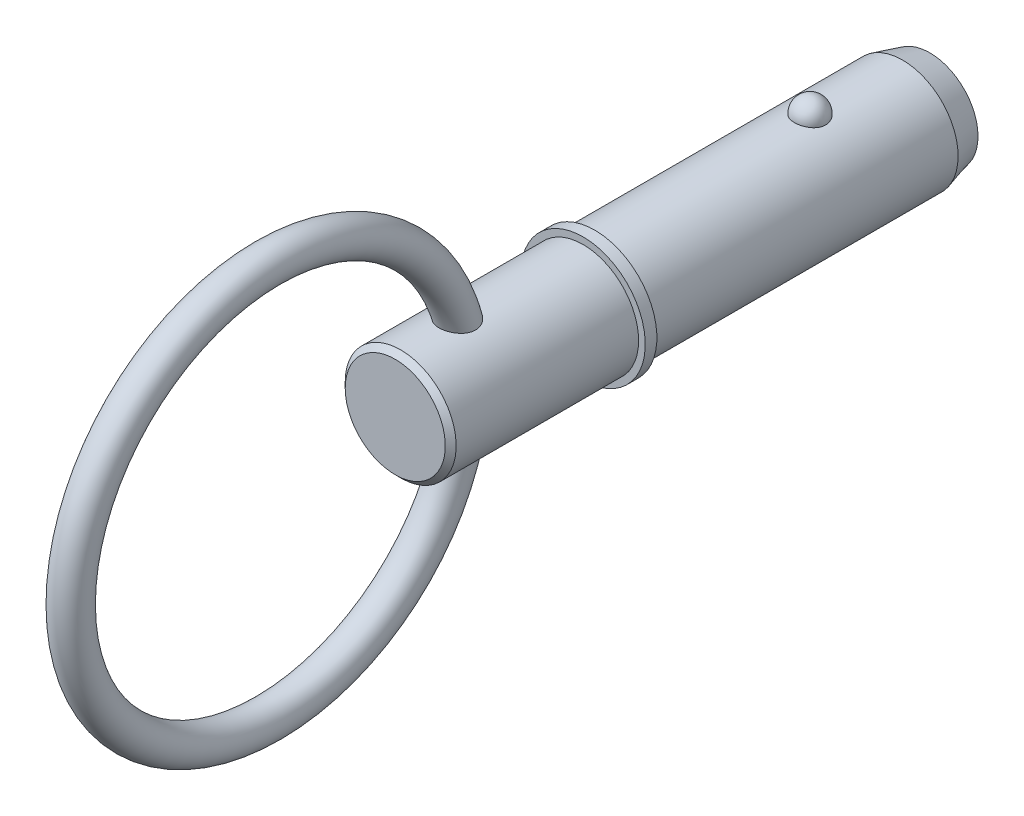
ISO-10303-21;
HEADER;
FILE_DESCRIPTION(('STEP AP214'),'2;1');
FILE_NAME('part.step','',(''),(''),'','','');
FILE_SCHEMA(('AUTOMOTIVE_DESIGN { 1 0 10303 214 1 1 1 1 }'));
ENDSEC;
DATA;
#1=APPLICATION_CONTEXT('core data for automotive mechanical design processes');
#2=APPLICATION_PROTOCOL_DEFINITION('international standard','automotive_design',2000,#1);
#3=PRODUCT_CONTEXT('',#1,'mechanical');
#4=PRODUCT('Part','Part','',(#3));
#5=PRODUCT_RELATED_PRODUCT_CATEGORY('part','',(#4));
#6=PRODUCT_DEFINITION_FORMATION('','',#4);
#7=PRODUCT_DEFINITION_CONTEXT('part definition',#1,'design');
#8=PRODUCT_DEFINITION('design','',#6,#7);
#9=PRODUCT_DEFINITION_SHAPE('','',#8);
#10=(LENGTH_UNIT() NAMED_UNIT(*) SI_UNIT(.MILLI.,.METRE.));
#11=(NAMED_UNIT(*) PLANE_ANGLE_UNIT() SI_UNIT($,.RADIAN.));
#12=(NAMED_UNIT(*) SI_UNIT($,.STERADIAN.) SOLID_ANGLE_UNIT());
#13=UNCERTAINTY_MEASURE_WITH_UNIT(LENGTH_MEASURE(1.E-05),#10,'distance_accuracy_value','');
#14=(GEOMETRIC_REPRESENTATION_CONTEXT(3) GLOBAL_UNCERTAINTY_ASSIGNED_CONTEXT((#13)) GLOBAL_UNIT_ASSIGNED_CONTEXT((#10,
#11,#12)) REPRESENTATION_CONTEXT('',''));
#15=CARTESIAN_POINT('',(0.,0.,0.));
#16=DIRECTION('',(0.,0.,1.));
#17=DIRECTION('',(1.,0.,0.));
#18=AXIS2_PLACEMENT_3D('',#15,#16,#17);
#19=CARTESIAN_POINT('',(0.,0.,25.7));
#20=DIRECTION('',(0.,0.,-1.));
#21=DIRECTION('',(-1.,0.,0.));
#22=AXIS2_PLACEMENT_3D('',#19,#20,#21);
#23=CYLINDRICAL_SURFACE('',#22,7.145);
#24=CARTESIAN_POINT('',(1.99971637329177,6.85945766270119,-2.01999999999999));
#25=CARTESIAN_POINT('',(1.9997145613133,6.85945924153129,-1.90709736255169));
#26=CARTESIAN_POINT('',(1.99051486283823,6.86216053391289,-1.79417185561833));
#27=CARTESIAN_POINT('',(1.95393597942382,6.87266409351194,-1.57152267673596));
#28=CARTESIAN_POINT('',(1.92655029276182,6.88046818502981,-1.46180016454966));
#29=CARTESIAN_POINT('',(1.85429435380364,6.90029063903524,-1.24873107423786));
#30=CARTESIAN_POINT('',(1.80943177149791,6.91230715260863,-1.14538172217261));
#31=CARTESIAN_POINT('',(1.70333474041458,6.93921158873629,-0.947875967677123));
#32=CARTESIAN_POINT('',(1.64210059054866,6.95409945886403,-0.853719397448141));
#33=CARTESIAN_POINT('',(1.5044381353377,6.98517577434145,-0.676721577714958));
#34=CARTESIAN_POINT('',(1.42793505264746,7.00137037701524,-0.593939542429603));
#35=CARTESIAN_POINT('',(1.26189697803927,7.03319066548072,-0.442536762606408));
#36=CARTESIAN_POINT('',(1.17236198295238,7.04881635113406,-0.373916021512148));
#37=CARTESIAN_POINT('',(0.982932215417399,7.0777121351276,-0.252935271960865));
#38=CARTESIAN_POINT('',(0.883068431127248,7.09098897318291,-0.200528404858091));
#39=CARTESIAN_POINT('',(0.675560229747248,7.11375589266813,-0.113212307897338));
#40=CARTESIAN_POINT('',(0.567916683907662,7.12324639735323,-0.0783011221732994));
#41=CARTESIAN_POINT('',(0.350006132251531,7.13724173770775,-0.0274707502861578));
#42=CARTESIAN_POINT('',(0.239822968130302,7.14183447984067,-0.0112162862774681));
#43=CARTESIAN_POINT('',(0.018194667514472,7.14583597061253,0.00296794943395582));
#44=CARTESIAN_POINT('',(-0.093250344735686,7.14524522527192,0.000899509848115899));
#45=CARTESIAN_POINT('',(-0.312527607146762,7.13899247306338,-0.0213331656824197));
#46=CARTESIAN_POINT('',(-0.420388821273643,7.13340426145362,-0.041234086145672));
#47=CARTESIAN_POINT('',(-0.631141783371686,7.11785474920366,-0.0982040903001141));
#48=CARTESIAN_POINT('',(-0.734033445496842,7.10789337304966,-0.135273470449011));
#49=CARTESIAN_POINT('',(-0.932634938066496,7.08458058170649,-0.225826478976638));
#50=CARTESIAN_POINT('',(-1.02829911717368,7.07120963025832,-0.279405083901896));
#51=CARTESIAN_POINT('',(-1.20927180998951,7.04252043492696,-0.401457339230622));
#52=CARTESIAN_POINT('',(-1.29457925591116,7.02720199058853,-0.469932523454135));
#53=CARTESIAN_POINT('',(-1.45423311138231,6.995926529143,-0.6214381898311));
#54=CARTESIAN_POINT('',(-1.5283348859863,6.97996288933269,-0.704725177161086));
#55=CARTESIAN_POINT('',(-1.66169281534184,6.94942414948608,-0.882667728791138));
#56=CARTESIAN_POINT('',(-1.72094789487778,6.93484915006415,-0.977324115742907));
#57=CARTESIAN_POINT('',(-1.82375276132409,6.90853186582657,-1.17661373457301));
#58=CARTESIAN_POINT('',(-1.86711024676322,6.8968248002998,-1.28135093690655));
#59=CARTESIAN_POINT('',(-1.9360425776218,6.87779420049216,-1.49689986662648));
#60=CARTESIAN_POINT('',(-1.96161794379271,6.87047053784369,-1.60771141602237));
#61=CARTESIAN_POINT('',(-1.99427437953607,6.86106309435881,-1.83176258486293));
#62=CARTESIAN_POINT('',(-2.00143373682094,6.8589571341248,-1.94498985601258));
#63=CARTESIAN_POINT('',(-1.99730449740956,6.86016064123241,-2.17107603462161));
#64=CARTESIAN_POINT('',(-1.98601641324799,6.86346995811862,-2.28393495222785));
#65=CARTESIAN_POINT('',(-1.94538181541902,6.87509649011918,-2.50548437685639));
#66=CARTESIAN_POINT('',(-1.91612773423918,6.88338806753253,-2.61419321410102));
#67=CARTESIAN_POINT('',(-1.84036449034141,6.90402888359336,-2.82501243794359));
#68=CARTESIAN_POINT('',(-1.79385462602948,6.91637828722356,-2.92712255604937));
#69=CARTESIAN_POINT('',(-1.68442067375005,6.94384180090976,-3.12247704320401));
#70=CARTESIAN_POINT('',(-1.62140729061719,6.95897081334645,-3.21566929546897));
#71=CARTESIAN_POINT('',(-1.4806650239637,6.99026742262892,-3.38999412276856));
#72=CARTESIAN_POINT('',(-1.40293556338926,7.00643506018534,-3.47112622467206));
#73=CARTESIAN_POINT('',(-1.2344320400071,7.03807960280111,-3.61938672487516));
#74=CARTESIAN_POINT('',(-1.1436092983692,7.05355363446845,-3.68646046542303));
#75=CARTESIAN_POINT('',(-0.9515914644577,7.08201263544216,-3.80431973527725));
#76=CARTESIAN_POINT('',(-0.850397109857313,7.09499778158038,-3.85510642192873));
#77=CARTESIAN_POINT('',(-0.641823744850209,7.11687679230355,-3.93839532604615));
#78=CARTESIAN_POINT('',(-0.534539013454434,7.1258202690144,-3.97112042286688));
#79=CARTESIAN_POINT('',(-0.315743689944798,7.1388605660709,-4.01830716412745));
#80=CARTESIAN_POINT('',(-0.204233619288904,7.14295798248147,-4.03277105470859));
#81=CARTESIAN_POINT('',(0.017551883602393,7.14582273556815,-4.04291389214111));
#82=CARTESIAN_POINT('',(0.127809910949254,7.14469090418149,-4.03894819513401));
#83=CARTESIAN_POINT('',(0.346044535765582,7.13745046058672,-4.01315850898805));
#84=CARTESIAN_POINT('',(0.454021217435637,7.13134203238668,-3.99133518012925));
#85=CARTESIAN_POINT('',(0.664227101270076,7.11483713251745,-3.93057164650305));
#86=CARTESIAN_POINT('',(0.766477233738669,7.10445761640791,-3.89169908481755));
#87=CARTESIAN_POINT('',(0.96292921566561,7.08050813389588,-3.79792023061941));
#88=CARTESIAN_POINT('',(1.05713054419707,7.06693796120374,-3.74301290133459));
#89=CARTESIAN_POINT('',(1.23644031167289,7.03780007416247,-3.61765173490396));
#90=CARTESIAN_POINT('',(1.32138387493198,7.0222044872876,-3.5469686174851));
#91=CARTESIAN_POINT('',(1.47830582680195,6.99085504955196,-3.39245228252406));
#92=CARTESIAN_POINT('',(1.55028198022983,6.97510117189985,-3.30861680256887));
#93=CARTESIAN_POINT('',(1.68063701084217,6.94485803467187,-3.12843058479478));
#94=CARTESIAN_POINT('',(1.73875175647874,6.93039619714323,-3.03188405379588));
#95=CARTESIAN_POINT('',(1.83823393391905,6.90467783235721,-2.83015210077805));
#96=CARTESIAN_POINT('',(1.87960712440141,6.89342020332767,-2.72496966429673));
#97=CARTESIAN_POINT('',(1.94111647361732,6.87633596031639,-2.52050234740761));
#98=CARTESIAN_POINT('',(1.96305249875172,6.87005682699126,-2.42179225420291));
#99=CARTESIAN_POINT('',(1.99235308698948,6.86161702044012,-2.22206084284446));
#100=CARTESIAN_POINT('',(1.99971799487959,6.85945624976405,-2.12103957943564));
#101=CARTESIAN_POINT('',(1.99971637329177,6.85945766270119,-2.01999999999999));
#102=B_SPLINE_CURVE_WITH_KNOTS('',3,(#24,#25,#26,#27,#28,#29,#30,#31,#32,#33,#34,#35,#36,#37,
#38,#39,#40,#41,#42,#43,#44,#45,#46,#47,#48,#49,#50,#51,#52,#53,#54,#55,#56,#57,#58,#59,#60,#61,
#62,#63,#64,#65,#66,#67,#68,#69,#70,#71,#72,#73,#74,#75,#76,#77,#78,#79,#80,#81,#82,#83,#84,#85,
#86,#87,#88,#89,#90,#91,#92,#93,#94,#95,#96,#97,#98,#99,#100,#101),.UNSPECIFIED.,.T.,.F.,(4,2,2,
2,2,2,2,2,2,2,2,2,2,2,2,2,2,2,2,2,2,2,2,2,2,2,2,2,2,2,2,2,2,2,2,2,2,2,4),(0.,0.338345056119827,
0.676811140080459,1.01512885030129,1.35344038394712,1.69345130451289,2.0334623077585,
2.37248128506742,2.71146235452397,3.04425125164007,3.37700766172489,3.70493009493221,
4.03285819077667,4.36270921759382,4.69259422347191,5.02887632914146,5.36518278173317,
5.70543263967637,6.04567253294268,6.38446363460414,6.72324532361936,7.06029846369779,
7.39736530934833,7.73629500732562,8.07523799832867,8.41547528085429,8.7556883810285,
9.09160363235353,9.42747756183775,9.75690239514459,10.0863150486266,10.4144324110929,
10.7425709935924,11.0758313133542,11.4091490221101,11.748385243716,12.0875046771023,
12.3903058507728,12.6930998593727),.UNSPECIFIED.);
#103=CARTESIAN_POINT('',(1.99971637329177,6.85945766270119,-2.01999999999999));
#104=VERTEX_POINT('',#103);
#105=EDGE_CURVE('E102',#104,#104,#102,.T.);
#106=ORIENTED_EDGE('',*,*,#105,.T.);
#107=EDGE_LOOP('',(#106));
#108=FACE_BOUND('',#107,.T.);
#109=CARTESIAN_POINT('',(0.,0.,-13.95));
#110=DIRECTION('',(0.,0.,-1.));
#111=DIRECTION('',(-1.,0.,0.));
#112=AXIS2_PLACEMENT_3D('',#109,#110,#111);
#113=CIRCLE('',#112,7.145);
#114=CARTESIAN_POINT('',(7.145,0.,-13.95));
#115=VERTEX_POINT('',#114);
#116=EDGE_CURVE('E109',#115,#115,#113,.F.);
#117=ORIENTED_EDGE('',*,*,#116,.T.);
#118=EDGE_LOOP('',(#117));
#119=FACE_BOUND('',#118,.T.);
#120=CARTESIAN_POINT('',(0.,0.,25.7));
#121=DIRECTION('',(0.,0.,1.));
#122=DIRECTION('',(1.,0.,0.));
#123=AXIS2_PLACEMENT_3D('',#120,#121,#122);
#124=CIRCLE('',#123,7.145);
#125=CARTESIAN_POINT('',(7.145,0.,25.7));
#126=VERTEX_POINT('',#125);
#127=EDGE_CURVE('E107',#126,#126,#124,.T.);
#128=ORIENTED_EDGE('',*,*,#127,.F.);
#129=EDGE_LOOP('',(#128));
#130=FACE_BOUND('',#129,.T.);
#131=ADVANCED_FACE('F39',(#108,#119,#130),#23,.T.);
#132=CARTESIAN_POINT('',(0.,0.,-17.45));
#133=DIRECTION('',(0.,0.,-1.));
#134=DIRECTION('',(-1.,0.,0.));
#135=AXIS2_PLACEMENT_3D('',#132,#133,#134);
#136=PLANE('',#135);
#137=CARTESIAN_POINT('',(0.,0.,-17.45));
#138=DIRECTION('',(0.,0.,-1.));
#139=DIRECTION('',(-1.,0.,0.));
#140=AXIS2_PLACEMENT_3D('',#137,#138,#139);
#141=CIRCLE('',#140,6.20717782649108);
#142=CARTESIAN_POINT('',(6.20717782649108,0.,-17.45));
#143=VERTEX_POINT('',#142);
#144=EDGE_CURVE('E141',#143,#143,#141,.T.);
#145=ORIENTED_EDGE('',*,*,#144,.T.);
#146=EDGE_LOOP('',(#145));
#147=FACE_BOUND('',#146,.T.);
#148=ADVANCED_FACE('F88',(#147),#136,.T.);
#149=CARTESIAN_POINT('',(0.,0.,-17.45));
#150=DIRECTION('',(0.,0.,1.));
#151=DIRECTION('',(1.,0.,0.));
#152=AXIS2_PLACEMENT_3D('',#149,#150,#151);
#153=CONICAL_SURFACE('',#152,6.20717782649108,0.261799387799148);
#154=CARTESIAN_POINT('',(7.145,0.,-13.95));
#155=CARTESIAN_POINT('',(7.13523101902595,0.,-13.9864583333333));
#156=CARTESIAN_POINT('',(7.1254620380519,0.,-14.0229166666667));
#157=CARTESIAN_POINT('',(7.1059240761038,0.,-14.0958333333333));
#158=CARTESIAN_POINT('',(7.09615509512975,0.,-14.1322916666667));
#159=CARTESIAN_POINT('',(7.07661713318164,0.,-14.2052083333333));
#160=CARTESIAN_POINT('',(7.06684815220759,0.,-14.2416666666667));
#161=CARTESIAN_POINT('',(7.04731019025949,0.,-14.3145833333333));
#162=CARTESIAN_POINT('',(7.03754120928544,0.,-14.3510416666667));
#163=CARTESIAN_POINT('',(7.01800324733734,0.,-14.4239583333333));
#164=CARTESIAN_POINT('',(7.00823426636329,0.,-14.4604166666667));
#165=CARTESIAN_POINT('',(6.98869630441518,0.,-14.5333333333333));
#166=CARTESIAN_POINT('',(6.97892732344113,0.,-14.5697916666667));
#167=CARTESIAN_POINT('',(6.95938936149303,0.,-14.6427083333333));
#168=CARTESIAN_POINT('',(6.94962038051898,0.,-14.6791666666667));
#169=CARTESIAN_POINT('',(6.93008241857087,0.,-14.7520833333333));
#170=CARTESIAN_POINT('',(6.92031343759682,0.,-14.7885416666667));
#171=CARTESIAN_POINT('',(6.90077547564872,0.,-14.8614583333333));
#172=CARTESIAN_POINT('',(6.89100649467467,0.,-14.8979166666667));
#173=CARTESIAN_POINT('',(6.87146853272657,0.,-14.9708333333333));
#174=CARTESIAN_POINT('',(6.86169955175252,0.,-15.0072916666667));
#175=CARTESIAN_POINT('',(6.84216158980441,0.,-15.0802083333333));
#176=CARTESIAN_POINT('',(6.83239260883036,0.,-15.1166666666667));
#177=CARTESIAN_POINT('',(6.81285464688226,0.,-15.1895833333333));
#178=CARTESIAN_POINT('',(6.80308566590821,0.,-15.2260416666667));
#179=CARTESIAN_POINT('',(6.78354770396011,0.,-15.2989583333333));
#180=CARTESIAN_POINT('',(6.77377872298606,0.,-15.3354166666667));
#181=CARTESIAN_POINT('',(6.75424076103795,0.,-15.4083333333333));
#182=CARTESIAN_POINT('',(6.7444717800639,0.,-15.4447916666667));
#183=CARTESIAN_POINT('',(6.7249338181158,0.,-15.5177083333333));
#184=CARTESIAN_POINT('',(6.71516483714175,0.,-15.5541666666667));
#185=CARTESIAN_POINT('',(6.69562687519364,0.,-15.6270833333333));
#186=CARTESIAN_POINT('',(6.68585789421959,0.,-15.6635416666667));
#187=CARTESIAN_POINT('',(6.66631993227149,0.,-15.7364583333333));
#188=CARTESIAN_POINT('',(6.65655095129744,0.,-15.7729166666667));
#189=CARTESIAN_POINT('',(6.63701298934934,0.,-15.8458333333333));
#190=CARTESIAN_POINT('',(6.62724400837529,0.,-15.8822916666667));
#191=CARTESIAN_POINT('',(6.60770604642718,0.,-15.9552083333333));
#192=CARTESIAN_POINT('',(6.59793706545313,0.,-15.9916666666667));
#193=CARTESIAN_POINT('',(6.57839910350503,0.,-16.0645833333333));
#194=CARTESIAN_POINT('',(6.56863012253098,0.,-16.1010416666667));
#195=CARTESIAN_POINT('',(6.54909216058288,0.,-16.1739583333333));
#196=CARTESIAN_POINT('',(6.53932317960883,0.,-16.2104166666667));
#197=CARTESIAN_POINT('',(6.51978521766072,0.,-16.2833333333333));
#198=CARTESIAN_POINT('',(6.51001623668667,0.,-16.3197916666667));
#199=CARTESIAN_POINT('',(6.49047827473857,0.,-16.3927083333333));
#200=CARTESIAN_POINT('',(6.48070929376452,0.,-16.4291666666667));
#201=CARTESIAN_POINT('',(6.46117133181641,0.,-16.5020833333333));
#202=CARTESIAN_POINT('',(6.45140235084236,0.,-16.5385416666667));
#203=CARTESIAN_POINT('',(6.43186438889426,0.,-16.6114583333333));
#204=CARTESIAN_POINT('',(6.42209540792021,0.,-16.6479166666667));
#205=CARTESIAN_POINT('',(6.40255744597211,0.,-16.7208333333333));
#206=CARTESIAN_POINT('',(6.39278846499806,0.,-16.7572916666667));
#207=CARTESIAN_POINT('',(6.37325050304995,0.,-16.8302083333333));
#208=CARTESIAN_POINT('',(6.3634815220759,0.,-16.8666666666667));
#209=CARTESIAN_POINT('',(6.3439435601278,0.,-16.9395833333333));
#210=CARTESIAN_POINT('',(6.33417457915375,0.,-16.9760416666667));
#211=CARTESIAN_POINT('',(6.31463661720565,0.,-17.0489583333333));
#212=CARTESIAN_POINT('',(6.3048676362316,0.,-17.0854166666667));
#213=CARTESIAN_POINT('',(6.28532967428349,0.,-17.1583333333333));
#214=CARTESIAN_POINT('',(6.27556069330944,0.,-17.1947916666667));
#215=CARTESIAN_POINT('',(6.25602273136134,0.,-17.2677083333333));
#216=CARTESIAN_POINT('',(6.24625375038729,0.,-17.3041666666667));
#217=CARTESIAN_POINT('',(6.22671578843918,0.,-17.3770833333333));
#218=CARTESIAN_POINT('',(6.21694680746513,0.,-17.4135416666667));
#219=CARTESIAN_POINT('',(6.20717782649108,0.,-17.45));
#220=B_SPLINE_CURVE_WITH_KNOTS('',3,(#154,#155,#156,#157,#158,#159,#160,#161,#162,#163,#164,
#165,#166,#167,#168,#169,#170,#171,#172,#173,#174,#175,#176,#177,#178,#179,#180,#181,#182,#183,
#184,#185,#186,#187,#188,#189,#190,#191,#192,#193,#194,#195,#196,#197,#198,#199,#200,#201,#202,
#203,#204,#205,#206,#207,#208,#209,#210,#211,#212,#213,#214,#215,#216,#217,#218,#219),
.UNSPECIFIED.,.F.,.F.,(4,2,2,2,2,2,2,2,2,2,2,2,2,2,2,2,2,2,2,2,2,2,2,2,2,2,2,2,2,2,2,2,4),(0.,
0.113233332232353,0.226466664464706,0.339699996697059,0.45293332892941,0.566166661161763,
0.679399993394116,0.792633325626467,0.90586665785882,1.01909999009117,1.13233332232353,
1.24556665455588,1.35879998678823,1.47203331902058,1.58526665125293,1.69849998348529,
1.81173331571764,1.92496664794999,2.03819998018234,2.1514333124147,2.26466664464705,
2.3778999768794,2.49113330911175,2.60436664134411,2.71759997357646,2.83083330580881,
2.94406663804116,3.05729997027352,3.17053330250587,3.28376663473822,3.39699996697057,
3.51023329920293,3.62346663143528),.UNSPECIFIED.);
#221=EDGE_CURVE('BSEAM94',#115,#143,#220,.T.);
#222=ORIENTED_EDGE('',*,*,#116,.F.);
#223=ORIENTED_EDGE('',*,*,#144,.F.);
#224=ORIENTED_EDGE('',*,*,#221,.T.);
#225=ORIENTED_EDGE('',*,*,#221,.F.);
#226=EDGE_LOOP('',(#222,#224,#223,#225));
#227=FACE_BOUND('',#226,.T.);
#228=ADVANCED_FACE('F94',(#227),#153,.T.);
#229=CARTESIAN_POINT('',(0.,7.145,-2.01999999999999));
#230=DIRECTION('',(0.,1.,0.));
#231=DIRECTION('',(0.,0.,-1.));
#232=AXIS2_PLACEMENT_3D('',#229,#230,#231);
#233=SPHERICAL_SURFACE('',#232,2.02);
#234=ORIENTED_EDGE('',*,*,#105,.F.);
#235=EDGE_LOOP('',(#234));
#236=FACE_BOUND('',#235,.T.);
#237=ADVANCED_FACE('F112',(#236),#233,.T.);
#238=CARTESIAN_POINT('',(0.,0.,25.7));
#239=DIRECTION('',(0.,0.,-1.));
#240=DIRECTION('',(-1.,0.,0.));
#241=AXIS2_PLACEMENT_3D('',#238,#239,#240);
#242=PLANE('',#241);
#243=ORIENTED_EDGE('',*,*,#127,.T.);
#244=EDGE_LOOP('',(#243));
#245=FACE_BOUND('',#244,.T.);
#246=CARTESIAN_POINT('',(0.,0.,25.7));
#247=DIRECTION('',(0.,0.,-1.));
#248=DIRECTION('',(-1.,0.,0.));
#249=AXIS2_PLACEMENT_3D('',#246,#247,#248);
#250=CIRCLE('',#249,8.);
#251=CARTESIAN_POINT('',(-8.,0.,25.7));
#252=VERTEX_POINT('',#251);
#253=EDGE_CURVE('E108',#252,#252,#250,.T.);
#254=ORIENTED_EDGE('',*,*,#253,.T.);
#255=EDGE_LOOP('',(#254));
#256=FACE_BOUND('',#255,.T.);
#257=ADVANCED_FACE('F116',(#245,#256),#242,.T.);
#258=CARTESIAN_POINT('',(0.,0.,33.7287874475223));
#259=DIRECTION('',(0.,0.,-1.));
#260=DIRECTION('',(-1.,0.,0.));
#261=AXIS2_PLACEMENT_3D('',#258,#259,#260);
#262=CYLINDRICAL_SURFACE('',#261,8.);
#263=CARTESIAN_POINT('',(0.,0.,27.2));
#264=DIRECTION('',(0.,0.,-1.));
#265=DIRECTION('',(-1.,0.,0.));
#266=AXIS2_PLACEMENT_3D('',#263,#264,#265);
#267=CIRCLE('',#266,8.);
#268=CARTESIAN_POINT('',(-8.,0.,27.2));
#269=VERTEX_POINT('',#268);
#270=EDGE_CURVE('E133',#269,#269,#267,.T.);
#271=ORIENTED_EDGE('',*,*,#270,.T.);
#272=EDGE_LOOP('',(#271));
#273=FACE_BOUND('',#272,.T.);
#274=ORIENTED_EDGE('',*,*,#253,.F.);
#275=EDGE_LOOP('',(#274));
#276=FACE_BOUND('',#275,.T.);
#277=ADVANCED_FACE('F120',(#273,#276),#262,.T.);
#278=CARTESIAN_POINT('',(0.,8.,27.2));
#279=DIRECTION('',(0.,0.,1.));
#280=DIRECTION('',(1.,0.,0.));
#281=AXIS2_PLACEMENT_3D('',#278,#279,#280);
#282=PLANE('',#281);
#283=CARTESIAN_POINT('',(0.,0.,27.2));
#284=DIRECTION('',(0.,0.,1.));
#285=DIRECTION('',(1.,0.,0.));
#286=AXIS2_PLACEMENT_3D('',#283,#284,#285);
#287=CIRCLE('',#286,7.145);
#288=CARTESIAN_POINT('',(7.145,0.,27.2));
#289=VERTEX_POINT('',#288);
#290=EDGE_CURVE('E111',#289,#289,#287,.T.);
#291=ORIENTED_EDGE('',*,*,#290,.F.);
#292=EDGE_LOOP('',(#291));
#293=FACE_BOUND('',#292,.T.);
#294=ORIENTED_EDGE('',*,*,#270,.F.);
#295=EDGE_LOOP('',(#294));
#296=FACE_BOUND('',#295,.T.);
#297=ADVANCED_FACE('F85',(#293,#296),#282,.T.);
#298=CARTESIAN_POINT('',(0.,0.,51.4));
#299=DIRECTION('',(0.,0.,-1.));
#300=DIRECTION('',(-1.,0.,0.));
#301=AXIS2_PLACEMENT_3D('',#298,#299,#300);
#302=CYLINDRICAL_SURFACE('',#301,7.145);
#303=CARTESIAN_POINT('',(-1.03551034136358,-7.0695645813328,41.3302593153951));
#304=CARTESIAN_POINT('',(-0.923225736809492,-7.08601142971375,41.274402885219));
#305=CARTESIAN_POINT('',(-0.806039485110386,-7.10042113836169,41.2278354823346));
#306=CARTESIAN_POINT('',(-0.565173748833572,-7.1236385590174,41.1542799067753));
#307=CARTESIAN_POINT('',(-0.441495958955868,-7.13244772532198,41.1272866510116));
#308=CARTESIAN_POINT('',(-0.191106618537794,-7.14354309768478,41.0934505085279));
#309=CARTESIAN_POINT('',(-0.064394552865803,-7.14582818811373,41.086611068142));
#310=CARTESIAN_POINT('',(0.188443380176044,-7.14363337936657,41.0932414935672));
#311=CARTESIAN_POINT('',(0.314569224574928,-7.13915321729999,41.1067121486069));
#312=CARTESIAN_POINT('',(0.562499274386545,-7.12390574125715,41.1536416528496));
#313=CARTESIAN_POINT('',(0.68430830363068,-7.11314569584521,41.1870773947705));
#314=CARTESIAN_POINT('',(0.920329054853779,-7.08647538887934,41.2731945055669));
#315=CARTESIAN_POINT('',(1.0345403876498,-7.07056486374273,41.3258768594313));
#316=CARTESIAN_POINT('',(1.2523263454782,-7.03526161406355,41.4494470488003));
#317=CARTESIAN_POINT('',(1.35588248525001,-7.01586299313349,41.5203658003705));
#318=CARTESIAN_POINT('',(1.54916093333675,-6.9757352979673,41.6787573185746));
#319=CARTESIAN_POINT('',(1.63888414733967,-6.95500631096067,41.7662290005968));
#320=CARTESIAN_POINT('',(1.80113983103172,-6.91475703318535,41.9547277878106));
#321=CARTESIAN_POINT('',(1.87381924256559,-6.89522757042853,42.0556263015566));
#322=CARTESIAN_POINT('',(2.00091178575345,-6.8594283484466,42.26884010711));
#323=CARTESIAN_POINT('',(2.05532963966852,-6.8431577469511,42.3811524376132));
#324=CARTESIAN_POINT('',(2.14350100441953,-6.81604873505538,42.6111948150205));
#325=CARTESIAN_POINT('',(2.17770329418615,-6.80509340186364,42.7287395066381));
#326=CARTESIAN_POINT('',(2.22691394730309,-6.7891497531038,42.968149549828));
#327=CARTESIAN_POINT('',(2.2419216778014,-6.7841616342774,43.0900150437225));
#328=CARTESIAN_POINT('',(2.25313992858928,-6.78044381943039,43.3358069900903));
#329=CARTESIAN_POINT('',(2.24917302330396,-6.78177319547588,43.4597420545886));
#330=CARTESIAN_POINT('',(2.22301329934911,-6.79039131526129,43.7054389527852));
#331=CARTESIAN_POINT('',(2.20081491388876,-6.79768187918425,43.8272001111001));
#332=CARTESIAN_POINT('',(2.13702421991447,-6.81801706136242,44.0752873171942));
#333=CARTESIAN_POINT('',(2.09404815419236,-6.83146790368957,44.2012230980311));
#334=CARTESIAN_POINT('',(1.98986384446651,-6.86253672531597,44.4448244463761));
#335=CARTESIAN_POINT('',(1.92864130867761,-6.88015796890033,44.5624834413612));
#336=CARTESIAN_POINT('',(1.7827436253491,-6.91947130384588,44.7974979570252));
#337=CARTESIAN_POINT('',(1.6964070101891,-6.94139021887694,44.9137892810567));
#338=CARTESIAN_POINT('',(1.50503944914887,-6.98537683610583,45.1297996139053));
#339=CARTESIAN_POINT('',(1.40001969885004,-7.00744444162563,45.229528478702));
#340=CARTESIAN_POINT('',(1.19221781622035,-7.04548349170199,45.393170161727));
#341=CARTESIAN_POINT('',(1.09203347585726,-7.06185586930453,45.4602859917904));
#342=CARTESIAN_POINT('',(0.881607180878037,-7.09119477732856,45.577337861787));
#343=CARTESIAN_POINT('',(0.771372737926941,-7.10416382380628,45.6272866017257));
#344=CARTESIAN_POINT('',(0.542622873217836,-7.12529560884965,45.707475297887));
#345=CARTESIAN_POINT('',(0.424058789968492,-7.13342692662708,45.7375865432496));
#346=CARTESIAN_POINT('',(0.183155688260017,-7.14366628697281,45.775370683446));
#347=CARTESIAN_POINT('',(0.0608191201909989,-7.14577815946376,45.783057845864));
#348=CARTESIAN_POINT('',(-0.169367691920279,-7.14381572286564,45.7758601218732));
#349=CARTESIAN_POINT('',(-0.27730825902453,-7.14040669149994,45.7634029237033));
#350=CARTESIAN_POINT('',(-0.489468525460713,-7.12900651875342,45.7211569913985));
#351=CARTESIAN_POINT('',(-0.593687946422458,-7.12101503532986,45.6913669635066));
#352=CARTESIAN_POINT('',(-0.796149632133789,-7.10123695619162,45.6159872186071));
#353=CARTESIAN_POINT('',(-0.894373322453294,-7.08943921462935,45.5703510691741));
#354=CARTESIAN_POINT('',(-1.08274371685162,-7.06312621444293,45.4653366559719));
#355=CARTESIAN_POINT('',(-1.17288754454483,-7.04860999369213,45.4059535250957));
#356=CARTESIAN_POINT('',(-1.35484961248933,-7.01605385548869,45.2671134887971));
#357=CARTESIAN_POINT('',(-1.44541008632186,-6.99780069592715,45.1860611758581));
#358=CARTESIAN_POINT('',(-1.61364655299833,-6.96093393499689,45.0115990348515));
#359=CARTESIAN_POINT('',(-1.69131381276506,-6.94232009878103,44.9181809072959));
#360=CARTESIAN_POINT('',(-1.843300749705,-6.90364386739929,44.7066087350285));
#361=CARTESIAN_POINT('',(-1.91543090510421,-6.88377370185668,44.5868392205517));
#362=CARTESIAN_POINT('',(-2.0400294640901,-6.84788436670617,44.3368759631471));
#363=CARTESIAN_POINT('',(-2.09248830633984,-6.83186707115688,44.2066771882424));
#364=CARTESIAN_POINT('',(-2.17795964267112,-6.80511869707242,43.9325553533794));
#365=CARTESIAN_POINT('',(-2.20992909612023,-6.79467512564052,43.7882740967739));
#366=CARTESIAN_POINT('',(-2.24813111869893,-6.78213595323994,43.4959843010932));
#367=CARTESIAN_POINT('',(-2.25438316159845,-6.78003403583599,43.3479786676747));
#368=CARTESIAN_POINT('',(-2.24011368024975,-6.78475868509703,43.0654300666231));
#369=CARTESIAN_POINT('',(-2.22172362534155,-6.79087455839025,42.9307692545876));
#370=CARTESIAN_POINT('',(-2.16145328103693,-6.81029672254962,42.6673673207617));
#371=CARTESIAN_POINT('',(-2.11958615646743,-6.82359898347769,42.5386229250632));
#372=CARTESIAN_POINT('',(-2.01784121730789,-6.85433303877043,42.3022679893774));
#373=CARTESIAN_POINT('',(-1.95982394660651,-6.8713108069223,42.1937922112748));
#374=CARTESIAN_POINT('',(-1.82642155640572,-6.90796511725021,41.9885914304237));
#375=CARTESIAN_POINT('',(-1.75103235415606,-6.92764229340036,41.8918691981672));
#376=CARTESIAN_POINT('',(-1.57825515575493,-6.96911949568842,41.7054086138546));
#377=CARTESIAN_POINT('',(-1.47957996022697,-6.9909623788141,41.6168703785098));
#378=CARTESIAN_POINT('',(-1.26760341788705,-7.0324852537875,41.458840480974));
#379=CARTESIAN_POINT('',(-1.15429989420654,-7.05216492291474,41.3893516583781));
#380=CARTESIAN_POINT('',(-1.03551034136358,-7.0695645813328,41.3302593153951));
#381=B_SPLINE_CURVE_WITH_KNOTS('',3,(#303,#304,#305,#306,#307,#308,#309,#310,#311,#312,#313,
#314,#315,#316,#317,#318,#319,#320,#321,#322,#323,#324,#325,#326,#327,#328,#329,#330,#331,#332,
#333,#334,#335,#336,#337,#338,#339,#340,#341,#342,#343,#344,#345,#346,#347,#348,#349,#350,#351,
#352,#353,#354,#355,#356,#357,#358,#359,#360,#361,#362,#363,#364,#365,#366,#367,#368,#369,#370,
#371,#372,#373,#374,#375,#376,#377,#378,#379,#380),.UNSPECIFIED.,.T.,.F.,(4,2,2,2,2,2,2,2,2,2,2,
2,2,2,2,2,2,2,2,2,2,2,2,2,2,2,2,2,2,2,2,2,2,2,2,2,2,2,4),(0.,0.378979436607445,
0.757860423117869,1.13680619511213,1.51576669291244,1.89428943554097,2.27283155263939,
2.65201969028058,3.03118299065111,3.40694616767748,3.78261210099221,4.14959041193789,
4.51658082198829,4.88700951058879,5.2575513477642,5.65713708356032,6.05703662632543,
6.49445595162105,6.93161403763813,7.29520224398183,7.65852089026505,8.02417421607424,
8.38959483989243,8.71415763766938,9.03874466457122,9.36429093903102,9.68995264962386,
10.0572255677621,10.4247462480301,10.8465602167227,11.2685789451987,11.7106604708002,
12.152407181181,12.5583067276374,12.9639788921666,13.3347314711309,13.7055712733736,
14.1064462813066,14.5073810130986),.UNSPECIFIED.);
#382=CARTESIAN_POINT('',(-1.03551034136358,-7.0695645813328,41.3302593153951));
#383=VERTEX_POINT('',#382);
#384=EDGE_CURVE('E10',#383,#383,#381,.T.);
#385=ORIENTED_EDGE('',*,*,#384,.F.);
#386=EDGE_LOOP('',(#385));
#387=FACE_BOUND('',#386,.T.);
#388=CARTESIAN_POINT('',(-1.03551034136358,7.0695645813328,41.3302593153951));
#389=CARTESIAN_POINT('',(-1.14644953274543,7.05331457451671,41.385446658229));
#390=CARTESIAN_POINT('',(-1.25260902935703,7.03507806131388,41.4497022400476));
#391=CARTESIAN_POINT('',(-1.45240021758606,6.99656564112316,41.5949589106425));
#392=CARTESIAN_POINT('',(-1.54602879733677,6.97628922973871,41.6759641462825));
#393=CARTESIAN_POINT('',(-1.71815091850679,6.93590796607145,41.8529100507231));
#394=CARTESIAN_POINT('',(-1.79663177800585,6.91580327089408,41.9488631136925));
#395=CARTESIAN_POINT('',(-1.9360771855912,6.87807159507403,42.1531625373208));
#396=CARTESIAN_POINT('',(-1.99704642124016,6.86044395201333,42.2615055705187));
#397=CARTESIAN_POINT('',(-2.09894945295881,6.82995115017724,42.4855428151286));
#398=CARTESIAN_POINT('',(-2.14021253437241,6.81700866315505,42.601076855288));
#399=CARTESIAN_POINT('',(-2.20347311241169,6.79682602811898,42.8377588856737));
#400=CARTESIAN_POINT('',(-2.22547114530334,6.78958572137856,42.9589067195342));
#401=CARTESIAN_POINT('',(-2.25026114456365,6.78140983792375,43.2032142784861));
#402=CARTESIAN_POINT('',(-2.25306986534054,6.78046876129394,43.3263721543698));
#403=CARTESIAN_POINT('',(-2.2403056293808,6.78469532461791,43.5716049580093));
#404=CARTESIAN_POINT('',(-2.22472720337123,6.78986478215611,43.6936795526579));
#405=CARTESIAN_POINT('',(-2.1747213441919,6.8060520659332,43.9420367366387));
#406=CARTESIAN_POINT('',(-2.13910164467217,6.81743831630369,44.0680537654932));
#407=CARTESIAN_POINT('',(-2.04975058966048,6.84483151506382,44.3129736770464));
#408=CARTESIAN_POINT('',(-1.99600968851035,6.86084089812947,44.4318727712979));
#409=CARTESIAN_POINT('',(-1.86558545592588,6.8975101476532,44.6714258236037));
#410=CARTESIAN_POINT('',(-1.78715729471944,6.91847353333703,44.7910877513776));
#411=CARTESIAN_POINT('',(-1.61149373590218,6.96148580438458,45.0156460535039));
#412=CARTESIAN_POINT('',(-1.51424701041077,6.98353533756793,45.1205334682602));
#413=CARTESIAN_POINT('',(-1.30107590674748,7.02639179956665,45.3129518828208));
#414=CARTESIAN_POINT('',(-1.1849228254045,7.04717858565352,45.4002366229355));
#415=CARTESIAN_POINT('',(-0.93739281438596,7.08434208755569,45.5508275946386));
#416=CARTESIAN_POINT('',(-0.806039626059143,7.10072555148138,45.6141705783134));
#417=CARTESIAN_POINT('',(-0.550470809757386,7.12475629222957,45.7054837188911));
#418=CARTESIAN_POINT('',(-0.427643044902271,7.13327781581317,45.7370470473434));
#419=CARTESIAN_POINT('',(-0.240556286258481,7.14122488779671,45.7663563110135));
#420=CARTESIAN_POINT('',(-0.177714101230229,7.14306799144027,45.7731199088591));
#421=CARTESIAN_POINT('',(-0.0516470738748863,7.14509121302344,45.7805390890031));
#422=CARTESIAN_POINT('',(0.0115777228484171,7.14527152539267,45.7811953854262));
#423=CARTESIAN_POINT('',(0.182932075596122,7.14347436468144,45.7746165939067));
#424=CARTESIAN_POINT('',(0.290871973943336,7.13986325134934,45.7614086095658));
#425=CARTESIAN_POINT('',(0.502842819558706,7.1280769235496,45.7176904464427));
#426=CARTESIAN_POINT('',(0.606873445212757,7.11990133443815,45.6871788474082));
#427=CARTESIAN_POINT('',(0.80900114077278,7.09978218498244,45.6103786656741));
#428=CARTESIAN_POINT('',(0.907071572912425,7.08782300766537,45.5640246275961));
#429=CARTESIAN_POINT('',(1.09503957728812,7.0612282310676,45.4576208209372));
#430=CARTESIAN_POINT('',(1.1849342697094,7.04659169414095,45.3975662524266));
#431=CARTESIAN_POINT('',(1.3664404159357,7.01380352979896,45.2572339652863));
#432=CARTESIAN_POINT('',(1.45676563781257,6.99544216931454,45.1753442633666));
#433=CARTESIAN_POINT('',(1.6244063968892,6.95842750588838,44.9992310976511));
#434=CARTESIAN_POINT('',(1.70171298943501,6.93977401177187,44.9049992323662));
#435=CARTESIAN_POINT('',(1.85271606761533,6.90111647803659,44.6918074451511));
#436=CARTESIAN_POINT('',(1.92421731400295,6.88131605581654,44.5712480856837));
#437=CARTESIAN_POINT('',(2.04739198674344,6.84567995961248,44.3197850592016));
#438=CARTESIAN_POINT('',(2.09905621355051,6.82984612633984,44.1888766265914));
#439=CARTESIAN_POINT('',(2.1825776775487,6.80363167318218,43.9138472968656));
#440=CARTESIAN_POINT('',(2.21345394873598,6.79352430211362,43.7693978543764));
#441=CARTESIAN_POINT('',(2.24941288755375,6.78170753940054,43.4769846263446));
#442=CARTESIAN_POINT('',(2.2545156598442,6.77999160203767,43.3290236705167));
#443=CARTESIAN_POINT('',(2.2380435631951,6.78544298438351,43.0470530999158));
#444=CARTESIAN_POINT('',(2.21864521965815,6.79188566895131,42.9129037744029));
#445=CARTESIAN_POINT('',(2.1564876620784,6.81187529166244,42.6506903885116));
#446=CARTESIAN_POINT('',(2.11373989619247,6.82541874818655,42.5226233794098));
#447=CARTESIAN_POINT('',(2.01040099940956,6.85652522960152,42.2875077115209));
#448=CARTESIAN_POINT('',(1.9516260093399,6.87365110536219,42.1795975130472));
#449=CARTESIAN_POINT('',(1.81683142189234,6.91050025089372,41.9756496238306));
#450=CARTESIAN_POINT('',(1.74081238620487,6.93022343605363,41.8796115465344));
#451=CARTESIAN_POINT('',(1.57431234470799,6.96992220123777,41.7025418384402));
#452=CARTESIAN_POINT('',(1.48394688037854,6.98989467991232,41.621400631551));
#453=CARTESIAN_POINT('',(1.29081365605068,7.02812243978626,41.4750381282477));
#454=CARTESIAN_POINT('',(1.18804491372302,7.04637758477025,41.4098180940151));
#455=CARTESIAN_POINT('',(0.970386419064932,7.07967210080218,41.2953776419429));
#456=CARTESIAN_POINT('',(0.855272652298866,7.09462807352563,41.2465586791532));
#457=CARTESIAN_POINT('',(0.618143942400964,7.11920826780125,41.1680711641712));
#458=CARTESIAN_POINT('',(0.496128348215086,7.12883198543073,41.1384044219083));
#459=CARTESIAN_POINT('',(0.247581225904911,7.14180209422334,41.0986987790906));
#460=CARTESIAN_POINT('',(0.121020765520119,7.14509609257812,41.0888236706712));
#461=CARTESIAN_POINT('',(-0.132022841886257,7.14489967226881,41.0894154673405));
#462=CARTESIAN_POINT('',(-0.258506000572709,7.14141109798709,41.0998768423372));
#463=CARTESIAN_POINT('',(-0.496649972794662,7.12862600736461,41.1390533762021));
#464=CARTESIAN_POINT('',(-0.608625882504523,7.11987587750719,41.1660553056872));
#465=CARTESIAN_POINT('',(-0.826925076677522,7.09783467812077,41.2362228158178));
#466=CARTESIAN_POINT('',(-0.933248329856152,7.08454358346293,41.2793884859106));
#467=CARTESIAN_POINT('',(-1.03551034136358,7.0695645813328,41.3302593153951));
#468=B_SPLINE_CURVE_WITH_KNOTS('',3,(#388,#389,#390,#391,#392,#393,#394,#395,#396,#397,#398,
#399,#400,#401,#402,#403,#404,#405,#406,#407,#408,#409,#410,#411,#412,#413,#414,#415,#416,#417,
#418,#419,#420,#421,#422,#423,#424,#425,#426,#427,#428,#429,#430,#431,#432,#433,#434,#435,#436,
#437,#438,#439,#440,#441,#442,#443,#444,#445,#446,#447,#448,#449,#450,#451,#452,#453,#454,#455,
#456,#457,#458,#459,#460,#461,#462,#463,#464,#465,#466,#467),.UNSPECIFIED.,.T.,.F.,(4,2,2,2,2,2,
2,2,2,2,2,2,2,2,2,2,2,2,2,2,2,2,2,2,2,2,2,2,2,2,2,2,2,2,2,2,2,2,2,4),(0.,0.374504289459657,
0.7491014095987,1.12401080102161,1.49881974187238,1.86712525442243,2.23542051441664,
2.60339417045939,2.97147730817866,3.36420696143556,3.75714381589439,4.18898920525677,
4.62109535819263,5.05888124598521,5.49599234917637,5.87475353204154,6.0641680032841,
6.25356032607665,6.57826179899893,6.90298992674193,7.22907626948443,7.55527703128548,
7.92373585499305,8.2924468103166,8.71527472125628,9.13829848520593,9.5800990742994,
10.0215549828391,10.4264139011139,10.831074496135,11.2014904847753,11.571894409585,
11.9394538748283,12.3070424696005,12.6830655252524,13.0591241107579,13.4382822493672,
13.8173372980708,14.1625475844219,14.5077597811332),.UNSPECIFIED.);
#469=CARTESIAN_POINT('',(-1.03551034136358,7.0695645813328,41.3302593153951));
#470=VERTEX_POINT('',#469);
#471=EDGE_CURVE('E51',#470,#470,#468,.T.);
#472=ORIENTED_EDGE('',*,*,#471,.F.);
#473=EDGE_LOOP('',(#472));
#474=FACE_BOUND('',#473,.T.);
#475=CARTESIAN_POINT('',(0.,0.,50.7));
#476=DIRECTION('',(0.,0.,-1.));
#477=DIRECTION('',(-1.,0.,0.));
#478=AXIS2_PLACEMENT_3D('',#475,#476,#477);
#479=CIRCLE('',#478,7.145);
#480=CARTESIAN_POINT('',(-7.145,0.,50.7));
#481=VERTEX_POINT('',#480);
#482=EDGE_CURVE('E64',#481,#481,#479,.T.);
#483=ORIENTED_EDGE('',*,*,#482,.T.);
#484=EDGE_LOOP('',(#483));
#485=FACE_BOUND('',#484,.T.);
#486=ORIENTED_EDGE('',*,*,#290,.T.);
#487=EDGE_LOOP('',(#486));
#488=FACE_BOUND('',#487,.T.);
#489=ADVANCED_FACE('F69',(#387,#474,#485,#488),#302,.T.);
#490=CARTESIAN_POINT('',(0.,0.,51.4));
#491=DIRECTION('',(0.,0.,-1.));
#492=DIRECTION('',(-1.,0.,0.));
#493=AXIS2_PLACEMENT_3D('',#490,#491,#492);
#494=PLANE('',#493);
#495=CARTESIAN_POINT('',(0.,0.,51.4));
#496=DIRECTION('',(0.,0.,-1.));
#497=DIRECTION('',(-1.,0.,0.));
#498=AXIS2_PLACEMENT_3D('',#495,#496,#497);
#499=CIRCLE('',#498,6.44499999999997);
#500=CARTESIAN_POINT('',(-6.44499999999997,0.,51.4));
#501=VERTEX_POINT('',#500);
#502=EDGE_CURVE('E58',#501,#501,#499,.F.);
#503=ORIENTED_EDGE('',*,*,#502,.T.);
#504=EDGE_LOOP('',(#503));
#505=FACE_BOUND('',#504,.T.);
#506=ADVANCED_FACE('F76',(#505),#494,.F.);
#507=CARTESIAN_POINT('',(0.,0.,50.7));
#508=DIRECTION('',(0.,0.,-1.));
#509=DIRECTION('',(-1.,0.,0.));
#510=AXIS2_PLACEMENT_3D('',#507,#508,#509);
#511=CONICAL_SURFACE('',#510,7.145,0.785398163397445);
#512=ORIENTED_EDGE('',*,*,#502,.F.);
#513=EDGE_LOOP('',(#512));
#514=FACE_BOUND('',#513,.T.);
#515=ORIENTED_EDGE('',*,*,#482,.F.);
#516=EDGE_LOOP('',(#515));
#517=FACE_BOUND('',#516,.T.);
#518=ADVANCED_FACE('F41',(#514,#517),#511,.T.);
#519=CARTESIAN_POINT('',(0.,0.,67.8));
#520=DIRECTION('',(1.,0.,0.));
#521=DIRECTION('',(0.,0.,-1.));
#522=AXIS2_PLACEMENT_3D('',#519,#520,#521);
#523=TOROIDAL_SURFACE('',#522,25.4,2.25);
#524=ORIENTED_EDGE('',*,*,#384,.T.);
#525=EDGE_LOOP('',(#524));
#526=FACE_BOUND('',#525,.T.);
#527=ORIENTED_EDGE('',*,*,#471,.T.);
#528=EDGE_LOOP('',(#527));
#529=FACE_BOUND('',#528,.T.);
#530=ADVANCED_FACE('F73',(#526,#529),#523,.T.);
#531=CLOSED_SHELL('',(#131,#148,#228,#237,#257,#277,#297,#489,#506,#518,#530));
#532=MANIFOLD_SOLID_BREP('B2',#531);
#533=ADVANCED_BREP_SHAPE_REPRESENTATION('',(#18,#532),#14);
#534=SHAPE_DEFINITION_REPRESENTATION(#9,#533);
ENDSEC;
END-ISO-10303-21;
